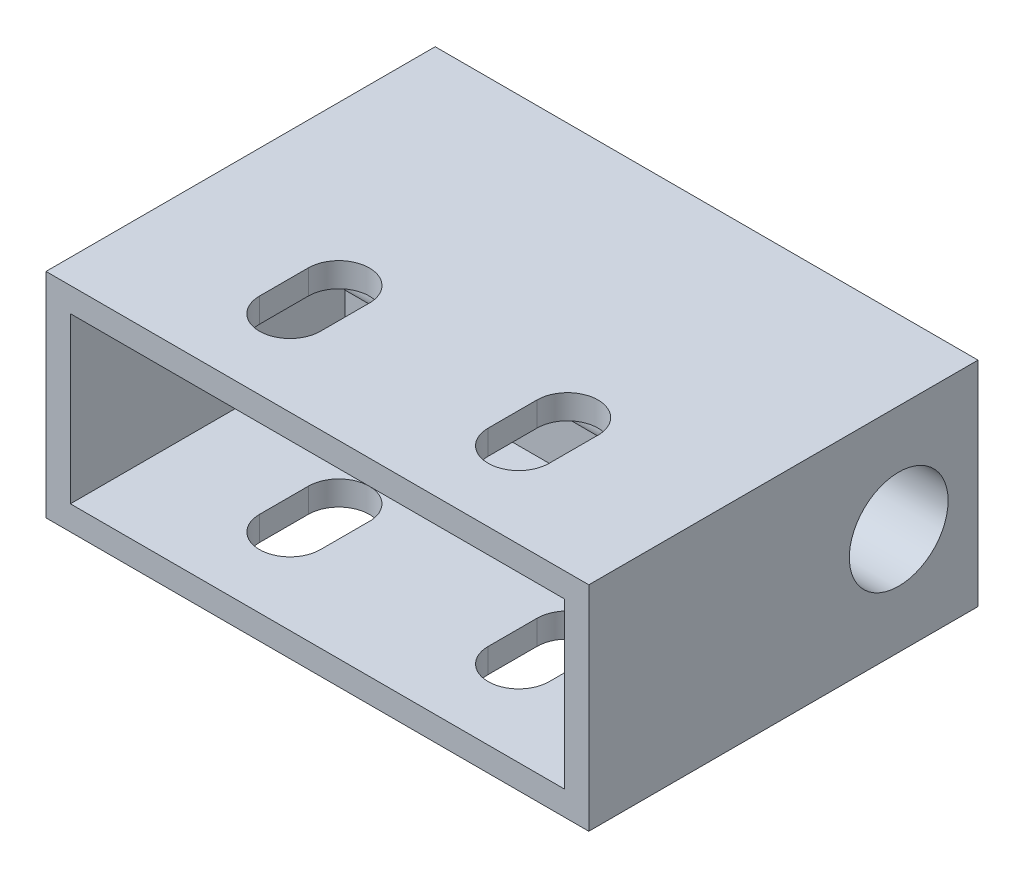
ISO-10303-21;
HEADER;
FILE_DESCRIPTION(('STEP AP214'),'2;1');
FILE_NAME('part.step','',(''),(''),'','','');
FILE_SCHEMA(('AUTOMOTIVE_DESIGN { 1 0 10303 214 1 1 1 1 }'));
ENDSEC;
DATA;
#1=APPLICATION_CONTEXT('core data for automotive mechanical design processes');
#2=APPLICATION_PROTOCOL_DEFINITION('international standard','automotive_design',2000,#1);
#3=PRODUCT_CONTEXT('',#1,'mechanical');
#4=PRODUCT('Part','Part','',(#3));
#5=PRODUCT_RELATED_PRODUCT_CATEGORY('part','',(#4));
#6=PRODUCT_DEFINITION_FORMATION('','',#4);
#7=PRODUCT_DEFINITION_CONTEXT('part definition',#1,'design');
#8=PRODUCT_DEFINITION('design','',#6,#7);
#9=PRODUCT_DEFINITION_SHAPE('','',#8);
#10=(LENGTH_UNIT() NAMED_UNIT(*) SI_UNIT(.MILLI.,.METRE.));
#11=(NAMED_UNIT(*) PLANE_ANGLE_UNIT() SI_UNIT($,.RADIAN.));
#12=(NAMED_UNIT(*) SI_UNIT($,.STERADIAN.) SOLID_ANGLE_UNIT());
#13=UNCERTAINTY_MEASURE_WITH_UNIT(LENGTH_MEASURE(1.E-05),#10,'distance_accuracy_value','');
#14=(GEOMETRIC_REPRESENTATION_CONTEXT(3) GLOBAL_UNCERTAINTY_ASSIGNED_CONTEXT((#13)) GLOBAL_UNIT_ASSIGNED_CONTEXT((#10,
#11,#12)) REPRESENTATION_CONTEXT('',''));
#15=CARTESIAN_POINT('',(0.,0.,0.));
#16=DIRECTION('',(0.,0.,1.));
#17=DIRECTION('',(1.,0.,0.));
#18=AXIS2_PLACEMENT_3D('',#15,#16,#17);
#19=CARTESIAN_POINT('',(0.,8.89,0.));
#20=DIRECTION('',(0.,-1.,0.));
#21=DIRECTION('',(0.,0.,-1.));
#22=AXIS2_PLACEMENT_3D('',#19,#20,#21);
#23=PLANE('',#22);
#24=DIRECTION('',(0.,0.,1.));
#25=VECTOR('',#24,1.);
#26=CARTESIAN_POINT('',(17.399,8.89,0.));
#27=LINE('',#26,#25);
#28=CARTESIAN_POINT('',(17.399,8.89,-5.4877915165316));
#29=VERTEX_POINT('',#28);
#30=CARTESIAN_POINT('',(17.399,8.89,-3.556));
#31=VERTEX_POINT('',#30);
#32=EDGE_CURVE('E59',#29,#31,#27,.T.);
#33=ORIENTED_EDGE('',*,*,#32,.T.);
#34=CARTESIAN_POINT('',(16.129,8.89,-3.556));
#35=DIRECTION('',(0.,1.,0.));
#36=DIRECTION('',(0.,0.,1.));
#37=AXIS2_PLACEMENT_3D('',#34,#35,#36);
#38=CIRCLE('',#37,1.27);
#39=CARTESIAN_POINT('',(14.859,8.89,-3.556));
#40=VERTEX_POINT('',#39);
#41=EDGE_CURVE('E251',#40,#31,#38,.T.);
#42=ORIENTED_EDGE('',*,*,#41,.F.);
#43=DIRECTION('',(0.,0.,1.));
#44=VECTOR('',#43,1.);
#45=CARTESIAN_POINT('',(14.859,8.89,0.));
#46=LINE('',#45,#44);
#47=CARTESIAN_POINT('',(14.859,8.89,-5.58799903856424));
#48=VERTEX_POINT('',#47);
#49=EDGE_CURVE('E248',#48,#40,#46,.T.);
#50=ORIENTED_EDGE('',*,*,#49,.F.);
#51=CARTESIAN_POINT('',(16.1309766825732,8.89,-5.58799903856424));
#52=DIRECTION('',(0.,1.,0.));
#53=DIRECTION('',(0.,0.,1.));
#54=AXIS2_PLACEMENT_3D('',#51,#52,#53);
#55=CIRCLE('',#54,1.27197668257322);
#56=EDGE_CURVE('E245',#29,#48,#55,.T.);
#57=ORIENTED_EDGE('',*,*,#56,.F.);
#58=EDGE_LOOP('',(#33,#42,#50,#57));
#59=FACE_BOUND('',#58,.T.);
#60=DIRECTION('',(0.,0.,1.));
#61=VECTOR('',#60,1.);
#62=CARTESIAN_POINT('',(0.,8.89,0.));
#63=LINE('',#62,#61);
#64=CARTESIAN_POINT('',(0.,8.89,-16.208375));
#65=VERTEX_POINT('',#64);
#66=CARTESIAN_POINT('',(0.,8.89,0.));
#67=VERTEX_POINT('',#66);
#68=EDGE_CURVE('E352',#65,#67,#63,.T.);
#69=ORIENTED_EDGE('',*,*,#68,.T.);
#70=DIRECTION('',(1.,0.,0.));
#71=VECTOR('',#70,1.);
#72=CARTESIAN_POINT('',(0.,8.89,0.));
#73=LINE('',#72,#71);
#74=CARTESIAN_POINT('',(22.606,8.89,0.));
#75=VERTEX_POINT('',#74);
#76=EDGE_CURVE('E355',#67,#75,#73,.T.);
#77=ORIENTED_EDGE('',*,*,#76,.T.);
#78=DIRECTION('',(0.,0.,-1.));
#79=VECTOR('',#78,1.);
#80=CARTESIAN_POINT('',(22.606,8.89,0.));
#81=LINE('',#80,#79);
#82=CARTESIAN_POINT('',(22.606,8.89,-16.208375));
#83=VERTEX_POINT('',#82);
#84=EDGE_CURVE('E358',#75,#83,#81,.T.);
#85=ORIENTED_EDGE('',*,*,#84,.T.);
#86=DIRECTION('',(-1.,0.,0.));
#87=VECTOR('',#86,1.);
#88=CARTESIAN_POINT('',(0.,8.89,-16.208375));
#89=LINE('',#88,#87);
#90=EDGE_CURVE('E360',#83,#65,#89,.T.);
#91=ORIENTED_EDGE('',*,*,#90,.T.);
#92=EDGE_LOOP('',(#69,#77,#85,#91));
#93=FACE_BOUND('',#92,.T.);
#94=DIRECTION('',(0.,0.,1.));
#95=VECTOR('',#94,1.);
#96=CARTESIAN_POINT('',(7.874,8.89,0.));
#97=LINE('',#96,#95);
#98=CARTESIAN_POINT('',(7.874,8.89,-5.48779151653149));
#99=VERTEX_POINT('',#98);
#100=CARTESIAN_POINT('',(7.874,8.89,-3.556));
#101=VERTEX_POINT('',#100);
#102=EDGE_CURVE('E51',#99,#101,#97,.T.);
#103=ORIENTED_EDGE('',*,*,#102,.T.);
#104=CARTESIAN_POINT('',(6.604,8.89,-3.556));
#105=DIRECTION('',(0.,1.,0.));
#106=DIRECTION('',(0.,0.,1.));
#107=AXIS2_PLACEMENT_3D('',#104,#105,#106);
#108=CIRCLE('',#107,1.27);
#109=CARTESIAN_POINT('',(5.334,8.89,-3.556));
#110=VERTEX_POINT('',#109);
#111=EDGE_CURVE('E232',#110,#101,#108,.T.);
#112=ORIENTED_EDGE('',*,*,#111,.F.);
#113=DIRECTION('',(0.,0.,1.));
#114=VECTOR('',#113,1.);
#115=CARTESIAN_POINT('',(5.334,8.89,0.));
#116=LINE('',#115,#114);
#117=CARTESIAN_POINT('',(5.334,8.89,-5.58799903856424));
#118=VERTEX_POINT('',#117);
#119=EDGE_CURVE('E216',#118,#110,#116,.T.);
#120=ORIENTED_EDGE('',*,*,#119,.F.);
#121=CARTESIAN_POINT('',(6.60597668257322,8.89,-5.58799903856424));
#122=DIRECTION('',(0.,1.,0.));
#123=DIRECTION('',(0.,0.,1.));
#124=AXIS2_PLACEMENT_3D('',#121,#122,#123);
#125=CIRCLE('',#124,1.27197668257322);
#126=EDGE_CURVE('E226',#99,#118,#125,.T.);
#127=ORIENTED_EDGE('',*,*,#126,.F.);
#128=EDGE_LOOP('',(#103,#112,#120,#127));
#129=FACE_BOUND('',#128,.T.);
#130=ADVANCED_FACE('F36',(#59,#93,#129),#23,.F.);
#131=CARTESIAN_POINT('',(0.,0.,0.));
#132=DIRECTION('',(0.,-1.,0.));
#133=DIRECTION('',(0.,0.,-1.));
#134=AXIS2_PLACEMENT_3D('',#131,#132,#133);
#135=PLANE('',#134);
#136=DIRECTION('',(0.,0.,1.));
#137=VECTOR('',#136,1.);
#138=CARTESIAN_POINT('',(0.,0.,0.));
#139=LINE('',#138,#137);
#140=CARTESIAN_POINT('',(0.,0.,-16.208375));
#141=VERTEX_POINT('',#140);
#142=CARTESIAN_POINT('',(0.,0.,0.));
#143=VERTEX_POINT('',#142);
#144=EDGE_CURVE('E345',#141,#143,#139,.T.);
#145=ORIENTED_EDGE('',*,*,#144,.F.);
#146=DIRECTION('',(-1.,0.,0.));
#147=VECTOR('',#146,1.);
#148=CARTESIAN_POINT('',(0.,0.,-16.208375));
#149=LINE('',#148,#147);
#150=CARTESIAN_POINT('',(22.606,0.,-16.208375));
#151=VERTEX_POINT('',#150);
#152=EDGE_CURVE('E356',#151,#141,#149,.T.);
#153=ORIENTED_EDGE('',*,*,#152,.F.);
#154=DIRECTION('',(0.,0.,-1.));
#155=VECTOR('',#154,1.);
#156=CARTESIAN_POINT('',(22.606,0.,0.));
#157=LINE('',#156,#155);
#158=CARTESIAN_POINT('',(22.606,0.,0.));
#159=VERTEX_POINT('',#158);
#160=EDGE_CURVE('E367',#159,#151,#157,.T.);
#161=ORIENTED_EDGE('',*,*,#160,.F.);
#162=DIRECTION('',(1.,0.,0.));
#163=VECTOR('',#162,1.);
#164=CARTESIAN_POINT('',(0.,0.,0.));
#165=LINE('',#164,#163);
#166=EDGE_CURVE('E365',#143,#159,#165,.T.);
#167=ORIENTED_EDGE('',*,*,#166,.F.);
#168=EDGE_LOOP('',(#145,#153,#161,#167));
#169=FACE_BOUND('',#168,.T.);
#170=CARTESIAN_POINT('',(16.129,0.,-3.556));
#171=DIRECTION('',(0.,-1.,0.));
#172=DIRECTION('',(0.,0.,-1.));
#173=AXIS2_PLACEMENT_3D('',#170,#171,#172);
#174=CIRCLE('',#173,1.27);
#175=CARTESIAN_POINT('',(17.399,0.,-3.556));
#176=VERTEX_POINT('',#175);
#177=CARTESIAN_POINT('',(14.859,0.,-3.556));
#178=VERTEX_POINT('',#177);
#179=EDGE_CURVE('E280',#176,#178,#174,.T.);
#180=ORIENTED_EDGE('',*,*,#179,.F.);
#181=DIRECTION('',(0.,0.,-1.));
#182=VECTOR('',#181,1.);
#183=CARTESIAN_POINT('',(17.399,0.,0.));
#184=LINE('',#183,#182);
#185=CARTESIAN_POINT('',(17.399,0.,-5.4877915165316));
#186=VERTEX_POINT('',#185);
#187=EDGE_CURVE('E284',#176,#186,#184,.T.);
#188=ORIENTED_EDGE('',*,*,#187,.T.);
#189=CARTESIAN_POINT('',(16.1309766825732,0.,-5.58799903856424));
#190=DIRECTION('',(0.,-1.,0.));
#191=DIRECTION('',(0.,0.,-1.));
#192=AXIS2_PLACEMENT_3D('',#189,#190,#191);
#193=CIRCLE('',#192,1.27197668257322);
#194=CARTESIAN_POINT('',(14.859,0.,-5.58799903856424));
#195=VERTEX_POINT('',#194);
#196=EDGE_CURVE('E269',#195,#186,#193,.T.);
#197=ORIENTED_EDGE('',*,*,#196,.F.);
#198=DIRECTION('',(0.,0.,-1.));
#199=VECTOR('',#198,1.);
#200=CARTESIAN_POINT('',(14.859,0.,0.));
#201=LINE('',#200,#199);
#202=EDGE_CURVE('E274',#178,#195,#201,.T.);
#203=ORIENTED_EDGE('',*,*,#202,.F.);
#204=EDGE_LOOP('',(#180,#188,#197,#203));
#205=FACE_BOUND('',#204,.T.);
#206=CARTESIAN_POINT('',(6.604,0.,-3.556));
#207=DIRECTION('',(0.,-1.,0.));
#208=DIRECTION('',(0.,0.,-1.));
#209=AXIS2_PLACEMENT_3D('',#206,#207,#208);
#210=CIRCLE('',#209,1.27);
#211=CARTESIAN_POINT('',(7.874,0.,-3.556));
#212=VERTEX_POINT('',#211);
#213=CARTESIAN_POINT('',(5.334,0.,-3.556));
#214=VERTEX_POINT('',#213);
#215=EDGE_CURVE('E298',#212,#214,#210,.T.);
#216=ORIENTED_EDGE('',*,*,#215,.F.);
#217=DIRECTION('',(0.,0.,-1.));
#218=VECTOR('',#217,1.);
#219=CARTESIAN_POINT('',(7.874,0.,0.));
#220=LINE('',#219,#218);
#221=CARTESIAN_POINT('',(7.874,0.,-5.48779151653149));
#222=VERTEX_POINT('',#221);
#223=EDGE_CURVE('E302',#212,#222,#220,.T.);
#224=ORIENTED_EDGE('',*,*,#223,.T.);
#225=CARTESIAN_POINT('',(6.60597668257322,0.,-5.58799903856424));
#226=DIRECTION('',(0.,-1.,0.));
#227=DIRECTION('',(0.,0.,-1.));
#228=AXIS2_PLACEMENT_3D('',#225,#226,#227);
#229=CIRCLE('',#228,1.27197668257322);
#230=CARTESIAN_POINT('',(5.334,0.,-5.58799903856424));
#231=VERTEX_POINT('',#230);
#232=EDGE_CURVE('E289',#231,#222,#229,.T.);
#233=ORIENTED_EDGE('',*,*,#232,.F.);
#234=DIRECTION('',(0.,0.,-1.));
#235=VECTOR('',#234,1.);
#236=CARTESIAN_POINT('',(5.334,0.,0.));
#237=LINE('',#236,#235);
#238=EDGE_CURVE('E292',#214,#231,#237,.T.);
#239=ORIENTED_EDGE('',*,*,#238,.F.);
#240=EDGE_LOOP('',(#216,#224,#233,#239));
#241=FACE_BOUND('',#240,.T.);
#242=ADVANCED_FACE('F418',(#169,#205,#241),#135,.T.);
#243=CARTESIAN_POINT('',(1.016,7.874,-11.43));
#244=DIRECTION('',(0.,1.,0.));
#245=DIRECTION('',(0.,0.,1.));
#246=AXIS2_PLACEMENT_3D('',#243,#244,#245);
#247=PLANE('',#246);
#248=DIRECTION('',(0.,0.,1.));
#249=VECTOR('',#248,1.);
#250=CARTESIAN_POINT('',(17.399,7.874,-11.43));
#251=LINE('',#250,#249);
#252=CARTESIAN_POINT('',(17.399,7.874,-5.4877915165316));
#253=VERTEX_POINT('',#252);
#254=CARTESIAN_POINT('',(17.399,7.874,-3.556));
#255=VERTEX_POINT('',#254);
#256=EDGE_CURVE('E282',#253,#255,#251,.T.);
#257=ORIENTED_EDGE('',*,*,#256,.F.);
#258=CARTESIAN_POINT('',(16.1309766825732,7.874,-5.58799903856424));
#259=DIRECTION('',(0.,1.,0.));
#260=DIRECTION('',(0.,0.,1.));
#261=AXIS2_PLACEMENT_3D('',#258,#259,#260);
#262=CIRCLE('',#261,1.27197668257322);
#263=CARTESIAN_POINT('',(14.859,7.874,-5.58799903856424));
#264=VERTEX_POINT('',#263);
#265=EDGE_CURVE('E266',#253,#264,#262,.T.);
#266=ORIENTED_EDGE('',*,*,#265,.T.);
#267=DIRECTION('',(0.,0.,1.));
#268=VECTOR('',#267,1.);
#269=CARTESIAN_POINT('',(14.859,7.874,-11.43));
#270=LINE('',#269,#268);
#271=CARTESIAN_POINT('',(14.859,7.874,-3.556));
#272=VERTEX_POINT('',#271);
#273=EDGE_CURVE('E271',#264,#272,#270,.T.);
#274=ORIENTED_EDGE('',*,*,#273,.T.);
#275=CARTESIAN_POINT('',(16.129,7.874,-3.556));
#276=DIRECTION('',(0.,1.,0.));
#277=DIRECTION('',(0.,0.,1.));
#278=AXIS2_PLACEMENT_3D('',#275,#276,#277);
#279=CIRCLE('',#278,1.27);
#280=EDGE_CURVE('E277',#272,#255,#279,.T.);
#281=ORIENTED_EDGE('',*,*,#280,.T.);
#282=EDGE_LOOP('',(#257,#266,#274,#281));
#283=FACE_BOUND('',#282,.T.);
#284=DIRECTION('',(-1.,0.,0.));
#285=VECTOR('',#284,1.);
#286=CARTESIAN_POINT('',(1.016,7.874,0.));
#287=LINE('',#286,#285);
#288=CARTESIAN_POINT('',(21.59,7.874,0.));
#289=VERTEX_POINT('',#288);
#290=CARTESIAN_POINT('',(1.016,7.874,0.));
#291=VERTEX_POINT('',#290);
#292=EDGE_CURVE('E340',#289,#291,#287,.T.);
#293=ORIENTED_EDGE('',*,*,#292,.T.);
#294=DIRECTION('',(0.,0.,1.));
#295=VECTOR('',#294,1.);
#296=CARTESIAN_POINT('',(1.016,7.874,-11.43));
#297=LINE('',#296,#295);
#298=CARTESIAN_POINT('',(1.016,7.874,-11.43));
#299=VERTEX_POINT('',#298);
#300=EDGE_CURVE('E343',#299,#291,#297,.T.);
#301=ORIENTED_EDGE('',*,*,#300,.F.);
#302=DIRECTION('',(-1.,0.,0.));
#303=VECTOR('',#302,1.);
#304=CARTESIAN_POINT('',(1.016,7.874,-11.43));
#305=LINE('',#304,#303);
#306=CARTESIAN_POINT('',(21.59,7.874,-11.43));
#307=VERTEX_POINT('',#306);
#308=EDGE_CURVE('E329',#307,#299,#305,.T.);
#309=ORIENTED_EDGE('',*,*,#308,.F.);
#310=DIRECTION('',(0.,0.,1.));
#311=VECTOR('',#310,1.);
#312=CARTESIAN_POINT('',(21.59,7.874,-11.43));
#313=LINE('',#312,#311);
#314=EDGE_CURVE('E346',#307,#289,#313,.T.);
#315=ORIENTED_EDGE('',*,*,#314,.T.);
#316=EDGE_LOOP('',(#293,#301,#309,#315));
#317=FACE_BOUND('',#316,.T.);
#318=DIRECTION('',(0.,0.,1.));
#319=VECTOR('',#318,1.);
#320=CARTESIAN_POINT('',(7.874,7.874,-11.43));
#321=LINE('',#320,#319);
#322=CARTESIAN_POINT('',(7.874,7.874,-5.48779151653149));
#323=VERTEX_POINT('',#322);
#324=CARTESIAN_POINT('',(7.874,7.874,-3.556));
#325=VERTEX_POINT('',#324);
#326=EDGE_CURVE('E300',#323,#325,#321,.T.);
#327=ORIENTED_EDGE('',*,*,#326,.F.);
#328=CARTESIAN_POINT('',(6.60597668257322,7.874,-5.58799903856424));
#329=DIRECTION('',(0.,1.,0.));
#330=DIRECTION('',(0.,0.,1.));
#331=AXIS2_PLACEMENT_3D('',#328,#329,#330);
#332=CIRCLE('',#331,1.27197668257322);
#333=CARTESIAN_POINT('',(5.334,7.874,-5.58799903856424));
#334=VERTEX_POINT('',#333);
#335=EDGE_CURVE('E287',#323,#334,#332,.T.);
#336=ORIENTED_EDGE('',*,*,#335,.T.);
#337=DIRECTION('',(0.,0.,1.));
#338=VECTOR('',#337,1.);
#339=CARTESIAN_POINT('',(5.334,7.874,-11.43));
#340=LINE('',#339,#338);
#341=CARTESIAN_POINT('',(5.334,7.874,-3.556));
#342=VERTEX_POINT('',#341);
#343=EDGE_CURVE('E219',#334,#342,#340,.T.);
#344=ORIENTED_EDGE('',*,*,#343,.T.);
#345=CARTESIAN_POINT('',(6.604,7.874,-3.556));
#346=DIRECTION('',(0.,1.,0.));
#347=DIRECTION('',(0.,0.,1.));
#348=AXIS2_PLACEMENT_3D('',#345,#346,#347);
#349=CIRCLE('',#348,1.27);
#350=EDGE_CURVE('E295',#342,#325,#349,.T.);
#351=ORIENTED_EDGE('',*,*,#350,.T.);
#352=EDGE_LOOP('',(#327,#336,#344,#351));
#353=FACE_BOUND('',#352,.T.);
#354=ADVANCED_FACE('F445',(#283,#317,#353),#247,.F.);
#355=CARTESIAN_POINT('',(1.016,1.016,-11.43));
#356=DIRECTION('',(0.,-1.,0.));
#357=DIRECTION('',(0.,0.,-1.));
#358=AXIS2_PLACEMENT_3D('',#355,#356,#357);
#359=PLANE('',#358);
#360=DIRECTION('',(0.,0.,-1.));
#361=VECTOR('',#360,1.);
#362=CARTESIAN_POINT('',(17.399,1.016,-11.43));
#363=LINE('',#362,#361);
#364=CARTESIAN_POINT('',(17.399,1.016,-3.556));
#365=VERTEX_POINT('',#364);
#366=CARTESIAN_POINT('',(17.399,1.016,-5.4877915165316));
#367=VERTEX_POINT('',#366);
#368=EDGE_CURVE('E394',#365,#367,#363,.T.);
#369=ORIENTED_EDGE('',*,*,#368,.F.);
#370=CARTESIAN_POINT('',(16.129,1.016,-3.556));
#371=DIRECTION('',(0.,-1.,0.));
#372=DIRECTION('',(0.,0.,-1.));
#373=AXIS2_PLACEMENT_3D('',#370,#371,#372);
#374=CIRCLE('',#373,1.27);
#375=CARTESIAN_POINT('',(14.859,1.016,-3.556));
#376=VERTEX_POINT('',#375);
#377=EDGE_CURVE('E391',#365,#376,#374,.T.);
#378=ORIENTED_EDGE('',*,*,#377,.T.);
#379=DIRECTION('',(0.,0.,-1.));
#380=VECTOR('',#379,1.);
#381=CARTESIAN_POINT('',(14.859,1.016,-11.43));
#382=LINE('',#381,#380);
#383=CARTESIAN_POINT('',(14.859,1.016,-5.58799903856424));
#384=VERTEX_POINT('',#383);
#385=EDGE_CURVE('E388',#376,#384,#382,.T.);
#386=ORIENTED_EDGE('',*,*,#385,.T.);
#387=CARTESIAN_POINT('',(16.1309766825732,1.016,-5.58799903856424));
#388=DIRECTION('',(0.,-1.,0.));
#389=DIRECTION('',(0.,0.,-1.));
#390=AXIS2_PLACEMENT_3D('',#387,#388,#389);
#391=CIRCLE('',#390,1.27197668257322);
#392=EDGE_CURVE('E385',#384,#367,#391,.T.);
#393=ORIENTED_EDGE('',*,*,#392,.T.);
#394=EDGE_LOOP('',(#369,#378,#386,#393));
#395=FACE_BOUND('',#394,.T.);
#396=DIRECTION('',(1.,0.,0.));
#397=VECTOR('',#396,1.);
#398=CARTESIAN_POINT('',(1.016,1.016,0.));
#399=LINE('',#398,#397);
#400=CARTESIAN_POINT('',(1.016,1.016,0.));
#401=VERTEX_POINT('',#400);
#402=CARTESIAN_POINT('',(21.59,1.016,0.));
#403=VERTEX_POINT('',#402);
#404=EDGE_CURVE('E334',#401,#403,#399,.T.);
#405=ORIENTED_EDGE('',*,*,#404,.T.);
#406=DIRECTION('',(0.,0.,1.));
#407=VECTOR('',#406,1.);
#408=CARTESIAN_POINT('',(21.59,1.016,-11.43));
#409=LINE('',#408,#407);
#410=CARTESIAN_POINT('',(21.59,1.016,-11.43));
#411=VERTEX_POINT('',#410);
#412=EDGE_CURVE('E348',#411,#403,#409,.T.);
#413=ORIENTED_EDGE('',*,*,#412,.F.);
#414=DIRECTION('',(1.,0.,0.));
#415=VECTOR('',#414,1.);
#416=CARTESIAN_POINT('',(1.016,1.016,-11.43));
#417=LINE('',#416,#415);
#418=CARTESIAN_POINT('',(1.016,1.016,-11.43));
#419=VERTEX_POINT('',#418);
#420=EDGE_CURVE('E321',#419,#411,#417,.T.);
#421=ORIENTED_EDGE('',*,*,#420,.F.);
#422=DIRECTION('',(0.,0.,1.));
#423=VECTOR('',#422,1.);
#424=CARTESIAN_POINT('',(1.016,1.016,-11.43));
#425=LINE('',#424,#423);
#426=EDGE_CURVE('E332',#419,#401,#425,.T.);
#427=ORIENTED_EDGE('',*,*,#426,.T.);
#428=EDGE_LOOP('',(#405,#413,#421,#427));
#429=FACE_BOUND('',#428,.T.);
#430=DIRECTION('',(0.,0.,-1.));
#431=VECTOR('',#430,1.);
#432=CARTESIAN_POINT('',(7.874,1.016,-11.43));
#433=LINE('',#432,#431);
#434=CARTESIAN_POINT('',(7.874,1.016,-3.556));
#435=VERTEX_POINT('',#434);
#436=CARTESIAN_POINT('',(7.874,1.016,-5.48779151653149));
#437=VERTEX_POINT('',#436);
#438=EDGE_CURVE('E11',#435,#437,#433,.T.);
#439=ORIENTED_EDGE('',*,*,#438,.F.);
#440=CARTESIAN_POINT('',(6.604,1.016,-3.556));
#441=DIRECTION('',(0.,-1.,0.));
#442=DIRECTION('',(0.,0.,-1.));
#443=AXIS2_PLACEMENT_3D('',#440,#441,#442);
#444=CIRCLE('',#443,1.27);
#445=CARTESIAN_POINT('',(5.334,1.016,-3.556));
#446=VERTEX_POINT('',#445);
#447=EDGE_CURVE('E44',#435,#446,#444,.T.);
#448=ORIENTED_EDGE('',*,*,#447,.T.);
#449=DIRECTION('',(0.,0.,-1.));
#450=VECTOR('',#449,1.);
#451=CARTESIAN_POINT('',(5.334,1.016,-11.43));
#452=LINE('',#451,#450);
#453=CARTESIAN_POINT('',(5.334,1.016,-5.58799903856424));
#454=VERTEX_POINT('',#453);
#455=EDGE_CURVE('E400',#446,#454,#452,.T.);
#456=ORIENTED_EDGE('',*,*,#455,.T.);
#457=CARTESIAN_POINT('',(6.60597668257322,1.016,-5.58799903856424));
#458=DIRECTION('',(0.,-1.,0.));
#459=DIRECTION('',(0.,0.,-1.));
#460=AXIS2_PLACEMENT_3D('',#457,#458,#459);
#461=CIRCLE('',#460,1.27197668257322);
#462=EDGE_CURVE('E397',#454,#437,#461,.T.);
#463=ORIENTED_EDGE('',*,*,#462,.T.);
#464=EDGE_LOOP('',(#439,#448,#456,#463));
#465=FACE_BOUND('',#464,.T.);
#466=ADVANCED_FACE('F405',(#395,#429,#465),#359,.F.);
#467=CARTESIAN_POINT('',(0.,0.,-11.43));
#468=DIRECTION('',(0.,0.,1.));
#469=DIRECTION('',(1.,0.,0.));
#470=AXIS2_PLACEMENT_3D('',#467,#468,#469);
#471=PLANE('',#470);
#472=DIRECTION('',(1.,0.,0.));
#473=VECTOR('',#472,1.);
#474=CARTESIAN_POINT('',(-31.4204800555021,3.01209678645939,-11.43));
#475=LINE('',#474,#473);
#476=CARTESIAN_POINT('',(1.016,3.01209678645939,-11.43));
#477=VERTEX_POINT('',#476);
#478=CARTESIAN_POINT('',(21.59,3.01209678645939,-11.43));
#479=VERTEX_POINT('',#478);
#480=EDGE_CURVE('E383',#477,#479,#475,.T.);
#481=ORIENTED_EDGE('',*,*,#480,.F.);
#482=DIRECTION('',(0.,-1.,0.));
#483=VECTOR('',#482,1.);
#484=CARTESIAN_POINT('',(1.016,7.874,-11.43));
#485=LINE('',#484,#483);
#486=EDGE_CURVE('E322',#477,#419,#485,.T.);
#487=ORIENTED_EDGE('',*,*,#486,.T.);
#488=ORIENTED_EDGE('',*,*,#420,.T.);
#489=DIRECTION('',(0.,1.,0.));
#490=VECTOR('',#489,1.);
#491=CARTESIAN_POINT('',(21.59,7.874,-11.43));
#492=LINE('',#491,#490);
#493=EDGE_CURVE('E326',#411,#479,#492,.T.);
#494=ORIENTED_EDGE('',*,*,#493,.T.);
#495=EDGE_LOOP('',(#481,#487,#488,#494));
#496=FACE_BOUND('',#495,.T.);
#497=ADVANCED_FACE('F466',(#496),#471,.T.);
#498=CARTESIAN_POINT('',(0.,8.89,0.));
#499=DIRECTION('',(1.,0.,0.));
#500=DIRECTION('',(0.,0.,-1.));
#501=AXIS2_PLACEMENT_3D('',#498,#499,#500);
#502=PLANE('',#501);
#503=CARTESIAN_POINT('',(0.,4.445,-12.906375));
#504=DIRECTION('',(1.,0.,0.));
#505=DIRECTION('',(0.,0.,-1.));
#506=AXIS2_PLACEMENT_3D('',#503,#504,#505);
#507=CIRCLE('',#506,2.0574);
#508=CARTESIAN_POINT('',(0.,4.445,-14.963775));
#509=VERTEX_POINT('',#508);
#510=EDGE_CURVE('E314',#509,#509,#507,.T.);
#511=ORIENTED_EDGE('',*,*,#510,.T.);
#512=EDGE_LOOP('',(#511));
#513=FACE_BOUND('',#512,.T.);
#514=ORIENTED_EDGE('',*,*,#144,.T.);
#515=DIRECTION('',(0.,-1.,0.));
#516=VECTOR('',#515,1.);
#517=CARTESIAN_POINT('',(0.,8.89,0.));
#518=LINE('',#517,#516);
#519=EDGE_CURVE('E378',#67,#143,#518,.T.);
#520=ORIENTED_EDGE('',*,*,#519,.F.);
#521=ORIENTED_EDGE('',*,*,#68,.F.);
#522=DIRECTION('',(0.,-1.,0.));
#523=VECTOR('',#522,1.);
#524=CARTESIAN_POINT('',(0.,8.89,-16.208375));
#525=LINE('',#524,#523);
#526=EDGE_CURVE('E362',#65,#141,#525,.T.);
#527=ORIENTED_EDGE('',*,*,#526,.T.);
#528=EDGE_LOOP('',(#514,#520,#521,#527));
#529=FACE_BOUND('',#528,.T.);
#530=ADVANCED_FACE('F38',(#513,#529),#502,.F.);
#531=CARTESIAN_POINT('',(0.,8.89,0.));
#532=DIRECTION('',(0.,0.,-1.));
#533=DIRECTION('',(-1.,0.,0.));
#534=AXIS2_PLACEMENT_3D('',#531,#532,#533);
#535=PLANE('',#534);
#536=ORIENTED_EDGE('',*,*,#404,.F.);
#537=DIRECTION('',(0.,-1.,0.));
#538=VECTOR('',#537,1.);
#539=CARTESIAN_POINT('',(1.016,7.874,0.));
#540=LINE('',#539,#538);
#541=EDGE_CURVE('E317',#291,#401,#540,.T.);
#542=ORIENTED_EDGE('',*,*,#541,.F.);
#543=ORIENTED_EDGE('',*,*,#292,.F.);
#544=DIRECTION('',(0.,1.,0.));
#545=VECTOR('',#544,1.);
#546=CARTESIAN_POINT('',(21.59,7.874,0.));
#547=LINE('',#546,#545);
#548=EDGE_CURVE('E337',#403,#289,#547,.T.);
#549=ORIENTED_EDGE('',*,*,#548,.F.);
#550=EDGE_LOOP('',(#536,#542,#543,#549));
#551=FACE_BOUND('',#550,.T.);
#552=ORIENTED_EDGE('',*,*,#166,.T.);
#553=DIRECTION('',(0.,-1.,0.));
#554=VECTOR('',#553,1.);
#555=CARTESIAN_POINT('',(22.606,8.89,0.));
#556=LINE('',#555,#554);
#557=EDGE_CURVE('E375',#75,#159,#556,.T.);
#558=ORIENTED_EDGE('',*,*,#557,.F.);
#559=ORIENTED_EDGE('',*,*,#76,.F.);
#560=ORIENTED_EDGE('',*,*,#519,.T.);
#561=EDGE_LOOP('',(#552,#558,#559,#560));
#562=FACE_BOUND('',#561,.T.);
#563=ADVANCED_FACE('F459',(#551,#562),#535,.F.);
#564=CARTESIAN_POINT('',(22.606,8.89,0.));
#565=DIRECTION('',(-1.,0.,0.));
#566=DIRECTION('',(0.,0.,1.));
#567=AXIS2_PLACEMENT_3D('',#564,#565,#566);
#568=PLANE('',#567);
#569=CARTESIAN_POINT('',(22.606,4.445,-12.906375));
#570=DIRECTION('',(1.,0.,0.));
#571=DIRECTION('',(0.,0.,-1.));
#572=AXIS2_PLACEMENT_3D('',#569,#570,#571);
#573=CIRCLE('',#572,2.0574);
#574=CARTESIAN_POINT('',(22.606,4.445,-14.963775));
#575=VERTEX_POINT('',#574);
#576=EDGE_CURVE('E305',#575,#575,#573,.T.);
#577=ORIENTED_EDGE('',*,*,#576,.F.);
#578=EDGE_LOOP('',(#577));
#579=FACE_BOUND('',#578,.T.);
#580=ORIENTED_EDGE('',*,*,#160,.T.);
#581=DIRECTION('',(0.,-1.,0.));
#582=VECTOR('',#581,1.);
#583=CARTESIAN_POINT('',(22.606,8.89,-16.208375));
#584=LINE('',#583,#582);
#585=EDGE_CURVE('E372',#83,#151,#584,.T.);
#586=ORIENTED_EDGE('',*,*,#585,.F.);
#587=ORIENTED_EDGE('',*,*,#84,.F.);
#588=ORIENTED_EDGE('',*,*,#557,.T.);
#589=EDGE_LOOP('',(#580,#586,#587,#588));
#590=FACE_BOUND('',#589,.T.);
#591=ADVANCED_FACE('F456',(#579,#590),#568,.F.);
#592=CARTESIAN_POINT('',(0.,8.89,-16.208375));
#593=DIRECTION('',(0.,0.,1.));
#594=DIRECTION('',(1.,0.,0.));
#595=AXIS2_PLACEMENT_3D('',#592,#593,#594);
#596=PLANE('',#595);
#597=ORIENTED_EDGE('',*,*,#152,.T.);
#598=ORIENTED_EDGE('',*,*,#526,.F.);
#599=ORIENTED_EDGE('',*,*,#90,.F.);
#600=ORIENTED_EDGE('',*,*,#585,.T.);
#601=EDGE_LOOP('',(#597,#598,#599,#600));
#602=FACE_BOUND('',#601,.T.);
#603=ADVANCED_FACE('F453',(#602),#596,.F.);
#604=CARTESIAN_POINT('',(1.016,7.874,-11.43));
#605=DIRECTION('',(-1.,0.,0.));
#606=DIRECTION('',(0.,-1.,0.));
#607=AXIS2_PLACEMENT_3D('',#604,#605,#606);
#608=PLANE('',#607);
#609=ORIENTED_EDGE('',*,*,#486,.F.);
#610=CARTESIAN_POINT('',(1.016,4.445,-12.906375));
#611=DIRECTION('',(-1.,0.,0.));
#612=DIRECTION('',(0.,-1.,0.));
#613=AXIS2_PLACEMENT_3D('',#610,#611,#612);
#614=CIRCLE('',#613,2.0574);
#615=CARTESIAN_POINT('',(1.016,5.87790321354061,-11.43));
#616=VERTEX_POINT('',#615);
#617=EDGE_CURVE('E311',#477,#616,#614,.T.);
#618=ORIENTED_EDGE('',*,*,#617,.T.);
#619=EDGE_CURVE('E318',#299,#616,#485,.T.);
#620=ORIENTED_EDGE('',*,*,#619,.F.);
#621=ORIENTED_EDGE('',*,*,#300,.T.);
#622=ORIENTED_EDGE('',*,*,#541,.T.);
#623=ORIENTED_EDGE('',*,*,#426,.F.);
#624=EDGE_LOOP('',(#609,#618,#620,#621,#622,#623));
#625=FACE_BOUND('',#624,.T.);
#626=ADVANCED_FACE('F450',(#625),#608,.F.);
#627=CARTESIAN_POINT('',(21.59,7.874,-11.43));
#628=DIRECTION('',(1.,0.,0.));
#629=DIRECTION('',(0.,0.,-1.));
#630=AXIS2_PLACEMENT_3D('',#627,#628,#629);
#631=PLANE('',#630);
#632=CARTESIAN_POINT('',(21.59,5.87790321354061,-11.43));
#633=VERTEX_POINT('',#632);
#634=EDGE_CURVE('E325',#633,#307,#492,.T.);
#635=ORIENTED_EDGE('',*,*,#634,.F.);
#636=CARTESIAN_POINT('',(21.59,4.445,-12.906375));
#637=DIRECTION('',(1.,0.,0.));
#638=DIRECTION('',(0.,0.,-1.));
#639=AXIS2_PLACEMENT_3D('',#636,#637,#638);
#640=CIRCLE('',#639,2.0574);
#641=EDGE_CURVE('E308',#633,#479,#640,.T.);
#642=ORIENTED_EDGE('',*,*,#641,.T.);
#643=ORIENTED_EDGE('',*,*,#493,.F.);
#644=ORIENTED_EDGE('',*,*,#412,.T.);
#645=ORIENTED_EDGE('',*,*,#548,.T.);
#646=ORIENTED_EDGE('',*,*,#314,.F.);
#647=EDGE_LOOP('',(#635,#642,#643,#644,#645,#646));
#648=FACE_BOUND('',#647,.T.);
#649=ADVANCED_FACE('F635',(#648),#631,.F.);
#650=DIRECTION('',(1.,0.,0.));
#651=VECTOR('',#650,1.);
#652=CARTESIAN_POINT('',(-31.4204800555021,5.87790321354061,-11.43));
#653=LINE('',#652,#651);
#654=EDGE_CURVE('E381',#633,#616,#653,.F.);
#655=ORIENTED_EDGE('',*,*,#654,.F.);
#656=ORIENTED_EDGE('',*,*,#634,.T.);
#657=ORIENTED_EDGE('',*,*,#308,.T.);
#658=ORIENTED_EDGE('',*,*,#619,.T.);
#659=EDGE_LOOP('',(#655,#656,#657,#658));
#660=FACE_BOUND('',#659,.T.);
#661=ADVANCED_FACE('F512',(#660),#471,.T.);
#662=CARTESIAN_POINT('',(-31.4204800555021,4.445,-12.906375));
#663=DIRECTION('',(1.,0.,0.));
#664=DIRECTION('',(0.,0.,-1.));
#665=AXIS2_PLACEMENT_3D('',#662,#663,#664);
#666=CYLINDRICAL_SURFACE('',#665,2.0574);
#667=ORIENTED_EDGE('',*,*,#576,.T.);
#668=EDGE_LOOP('',(#667));
#669=FACE_BOUND('',#668,.T.);
#670=ORIENTED_EDGE('',*,*,#480,.T.);
#671=ORIENTED_EDGE('',*,*,#641,.F.);
#672=ORIENTED_EDGE('',*,*,#654,.T.);
#673=ORIENTED_EDGE('',*,*,#617,.F.);
#674=EDGE_LOOP('',(#670,#671,#672,#673));
#675=FACE_BOUND('',#674,.T.);
#676=ORIENTED_EDGE('',*,*,#510,.F.);
#677=EDGE_LOOP('',(#676));
#678=FACE_BOUND('',#677,.T.);
#679=ADVANCED_FACE('F503',(#669,#675,#678),#666,.F.);
#680=CARTESIAN_POINT('',(16.1309766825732,-13.8944800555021,-5.58799903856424));
#681=DIRECTION('',(0.,1.,0.));
#682=DIRECTION('',(0.,0.,1.));
#683=AXIS2_PLACEMENT_3D('',#680,#681,#682);
#684=CYLINDRICAL_SURFACE('',#683,1.27197668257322);
#685=ORIENTED_EDGE('',*,*,#196,.T.);
#686=DIRECTION('',(0.,1.,0.));
#687=VECTOR('',#686,1.);
#688=CARTESIAN_POINT('',(17.399,-13.8944800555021,-5.4877915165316));
#689=LINE('',#688,#687);
#690=EDGE_CURVE('E264',#186,#367,#689,.T.);
#691=ORIENTED_EDGE('',*,*,#690,.T.);
#692=ORIENTED_EDGE('',*,*,#392,.F.);
#693=DIRECTION('',(0.,1.,0.));
#694=VECTOR('',#693,1.);
#695=CARTESIAN_POINT('',(14.859,-13.8944800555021,-5.58799903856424));
#696=LINE('',#695,#694);
#697=EDGE_CURVE('E261',#195,#384,#696,.T.);
#698=ORIENTED_EDGE('',*,*,#697,.F.);
#699=EDGE_LOOP('',(#685,#691,#692,#698));
#700=FACE_BOUND('',#699,.T.);
#701=ADVANCED_FACE('F501',(#700),#684,.F.);
#702=CARTESIAN_POINT('',(14.859,-13.8944800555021,0.));
#703=DIRECTION('',(-1.,0.,0.));
#704=DIRECTION('',(0.,0.,1.));
#705=AXIS2_PLACEMENT_3D('',#702,#703,#704);
#706=PLANE('',#705);
#707=ORIENTED_EDGE('',*,*,#202,.T.);
#708=ORIENTED_EDGE('',*,*,#697,.T.);
#709=ORIENTED_EDGE('',*,*,#385,.F.);
#710=DIRECTION('',(0.,1.,0.));
#711=VECTOR('',#710,1.);
#712=CARTESIAN_POINT('',(14.859,-13.8944800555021,-3.556));
#713=LINE('',#712,#711);
#714=EDGE_CURVE('E258',#178,#376,#713,.T.);
#715=ORIENTED_EDGE('',*,*,#714,.F.);
#716=EDGE_LOOP('',(#707,#708,#709,#715));
#717=FACE_BOUND('',#716,.T.);
#718=ADVANCED_FACE('F494',(#717),#706,.F.);
#719=CARTESIAN_POINT('',(16.129,-13.8944800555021,-3.556));
#720=DIRECTION('',(0.,1.,0.));
#721=DIRECTION('',(0.,0.,1.));
#722=AXIS2_PLACEMENT_3D('',#719,#720,#721);
#723=CYLINDRICAL_SURFACE('',#722,1.27);
#724=ORIENTED_EDGE('',*,*,#179,.T.);
#725=ORIENTED_EDGE('',*,*,#714,.T.);
#726=ORIENTED_EDGE('',*,*,#377,.F.);
#727=DIRECTION('',(0.,1.,0.));
#728=VECTOR('',#727,1.);
#729=CARTESIAN_POINT('',(17.399,-13.8944800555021,-3.556));
#730=LINE('',#729,#728);
#731=EDGE_CURVE('E257',#176,#365,#730,.T.);
#732=ORIENTED_EDGE('',*,*,#731,.F.);
#733=EDGE_LOOP('',(#724,#725,#726,#732));
#734=FACE_BOUND('',#733,.T.);
#735=ADVANCED_FACE('F433',(#734),#723,.F.);
#736=CARTESIAN_POINT('',(17.399,-13.8944800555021,0.));
#737=DIRECTION('',(-1.,0.,0.));
#738=DIRECTION('',(0.,0.,1.));
#739=AXIS2_PLACEMENT_3D('',#736,#737,#738);
#740=PLANE('',#739);
#741=ORIENTED_EDGE('',*,*,#731,.T.);
#742=ORIENTED_EDGE('',*,*,#368,.T.);
#743=ORIENTED_EDGE('',*,*,#690,.F.);
#744=ORIENTED_EDGE('',*,*,#187,.F.);
#745=EDGE_LOOP('',(#741,#742,#743,#744));
#746=FACE_BOUND('',#745,.T.);
#747=ADVANCED_FACE('F426',(#746),#740,.T.);
#748=CARTESIAN_POINT('',(6.60597668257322,-13.8944800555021,-5.58799903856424));
#749=DIRECTION('',(0.,1.,0.));
#750=DIRECTION('',(0.,0.,1.));
#751=AXIS2_PLACEMENT_3D('',#748,#749,#750);
#752=CYLINDRICAL_SURFACE('',#751,1.27197668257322);
#753=ORIENTED_EDGE('',*,*,#232,.T.);
#754=DIRECTION('',(0.,1.,0.));
#755=VECTOR('',#754,1.);
#756=CARTESIAN_POINT('',(7.874,-13.8944800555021,-5.48779151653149));
#757=LINE('',#756,#755);
#758=EDGE_CURVE('E223',#222,#437,#757,.T.);
#759=ORIENTED_EDGE('',*,*,#758,.T.);
#760=ORIENTED_EDGE('',*,*,#462,.F.);
#761=DIRECTION('',(0.,1.,0.));
#762=VECTOR('',#761,1.);
#763=CARTESIAN_POINT('',(5.334,-13.8944800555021,-5.58799903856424));
#764=LINE('',#763,#762);
#765=EDGE_CURVE('E222',#231,#454,#764,.T.);
#766=ORIENTED_EDGE('',*,*,#765,.F.);
#767=EDGE_LOOP('',(#753,#759,#760,#766));
#768=FACE_BOUND('',#767,.T.);
#769=ADVANCED_FACE('F424',(#768),#752,.F.);
#770=CARTESIAN_POINT('',(5.334,-13.8944800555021,0.));
#771=DIRECTION('',(-1.,0.,0.));
#772=DIRECTION('',(0.,0.,1.));
#773=AXIS2_PLACEMENT_3D('',#770,#771,#772);
#774=PLANE('',#773);
#775=ORIENTED_EDGE('',*,*,#238,.T.);
#776=ORIENTED_EDGE('',*,*,#765,.T.);
#777=ORIENTED_EDGE('',*,*,#455,.F.);
#778=DIRECTION('',(0.,1.,0.));
#779=VECTOR('',#778,1.);
#780=CARTESIAN_POINT('',(5.334,-13.8944800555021,-3.556));
#781=LINE('',#780,#779);
#782=EDGE_CURVE('E240',#214,#446,#781,.T.);
#783=ORIENTED_EDGE('',*,*,#782,.F.);
#784=EDGE_LOOP('',(#775,#776,#777,#783));
#785=FACE_BOUND('',#784,.T.);
#786=ADVANCED_FACE('F421',(#785),#774,.F.);
#787=CARTESIAN_POINT('',(6.604,-13.8944800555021,-3.556));
#788=DIRECTION('',(0.,1.,0.));
#789=DIRECTION('',(0.,0.,1.));
#790=AXIS2_PLACEMENT_3D('',#787,#788,#789);
#791=CYLINDRICAL_SURFACE('',#790,1.27);
#792=ORIENTED_EDGE('',*,*,#215,.T.);
#793=ORIENTED_EDGE('',*,*,#782,.T.);
#794=ORIENTED_EDGE('',*,*,#447,.F.);
#795=DIRECTION('',(0.,1.,0.));
#796=VECTOR('',#795,1.);
#797=CARTESIAN_POINT('',(7.874,-13.8944800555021,-3.556));
#798=LINE('',#797,#796);
#799=EDGE_CURVE('E239',#212,#435,#798,.T.);
#800=ORIENTED_EDGE('',*,*,#799,.F.);
#801=EDGE_LOOP('',(#792,#793,#794,#800));
#802=FACE_BOUND('',#801,.T.);
#803=ADVANCED_FACE('F410',(#802),#791,.F.);
#804=CARTESIAN_POINT('',(7.874,-13.8944800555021,0.));
#805=DIRECTION('',(-1.,0.,0.));
#806=DIRECTION('',(0.,0.,1.));
#807=AXIS2_PLACEMENT_3D('',#804,#805,#806);
#808=PLANE('',#807);
#809=ORIENTED_EDGE('',*,*,#799,.T.);
#810=ORIENTED_EDGE('',*,*,#438,.T.);
#811=ORIENTED_EDGE('',*,*,#758,.F.);
#812=ORIENTED_EDGE('',*,*,#223,.F.);
#813=EDGE_LOOP('',(#809,#810,#811,#812));
#814=FACE_BOUND('',#813,.T.);
#815=ADVANCED_FACE('F414',(#814),#808,.T.);
#816=ORIENTED_EDGE('',*,*,#256,.T.);
#817=EDGE_CURVE('E255',#255,#31,#730,.T.);
#818=ORIENTED_EDGE('',*,*,#817,.T.);
#819=ORIENTED_EDGE('',*,*,#32,.F.);
#820=EDGE_CURVE('E254',#253,#29,#689,.T.);
#821=ORIENTED_EDGE('',*,*,#820,.F.);
#822=EDGE_LOOP('',(#816,#818,#819,#821));
#823=FACE_BOUND('',#822,.T.);
#824=ADVANCED_FACE('F436',(#823),#740,.T.);
#825=EDGE_CURVE('E259',#272,#40,#713,.T.);
#826=ORIENTED_EDGE('',*,*,#825,.T.);
#827=ORIENTED_EDGE('',*,*,#41,.T.);
#828=ORIENTED_EDGE('',*,*,#817,.F.);
#829=ORIENTED_EDGE('',*,*,#280,.F.);
#830=EDGE_LOOP('',(#826,#827,#828,#829));
#831=FACE_BOUND('',#830,.T.);
#832=ADVANCED_FACE('F523',(#831),#723,.F.);
#833=EDGE_CURVE('E262',#264,#48,#696,.T.);
#834=ORIENTED_EDGE('',*,*,#833,.T.);
#835=ORIENTED_EDGE('',*,*,#49,.T.);
#836=ORIENTED_EDGE('',*,*,#825,.F.);
#837=ORIENTED_EDGE('',*,*,#273,.F.);
#838=EDGE_LOOP('',(#834,#835,#836,#837));
#839=FACE_BOUND('',#838,.T.);
#840=ADVANCED_FACE('F511',(#839),#706,.F.);
#841=ORIENTED_EDGE('',*,*,#820,.T.);
#842=ORIENTED_EDGE('',*,*,#56,.T.);
#843=ORIENTED_EDGE('',*,*,#833,.F.);
#844=ORIENTED_EDGE('',*,*,#265,.F.);
#845=EDGE_LOOP('',(#841,#842,#843,#844));
#846=FACE_BOUND('',#845,.T.);
#847=ADVANCED_FACE('F505',(#846),#684,.F.);
#848=ORIENTED_EDGE('',*,*,#326,.T.);
#849=EDGE_CURVE('E237',#325,#101,#798,.T.);
#850=ORIENTED_EDGE('',*,*,#849,.T.);
#851=ORIENTED_EDGE('',*,*,#102,.F.);
#852=EDGE_CURVE('E228',#323,#99,#757,.T.);
#853=ORIENTED_EDGE('',*,*,#852,.F.);
#854=EDGE_LOOP('',(#848,#850,#851,#853));
#855=FACE_BOUND('',#854,.T.);
#856=ADVANCED_FACE('F516',(#855),#808,.T.);
#857=EDGE_CURVE('E241',#342,#110,#781,.T.);
#858=ORIENTED_EDGE('',*,*,#857,.T.);
#859=ORIENTED_EDGE('',*,*,#111,.T.);
#860=ORIENTED_EDGE('',*,*,#849,.F.);
#861=ORIENTED_EDGE('',*,*,#350,.F.);
#862=EDGE_LOOP('',(#858,#859,#860,#861));
#863=FACE_BOUND('',#862,.T.);
#864=ADVANCED_FACE('F522',(#863),#791,.F.);
#865=EDGE_CURVE('E211',#334,#118,#764,.T.);
#866=ORIENTED_EDGE('',*,*,#865,.T.);
#867=ORIENTED_EDGE('',*,*,#119,.T.);
#868=ORIENTED_EDGE('',*,*,#857,.F.);
#869=ORIENTED_EDGE('',*,*,#343,.F.);
#870=EDGE_LOOP('',(#866,#867,#868,#869));
#871=FACE_BOUND('',#870,.T.);
#872=ADVANCED_FACE('F213',(#871),#774,.F.);
#873=ORIENTED_EDGE('',*,*,#852,.T.);
#874=ORIENTED_EDGE('',*,*,#126,.T.);
#875=ORIENTED_EDGE('',*,*,#865,.F.);
#876=ORIENTED_EDGE('',*,*,#335,.F.);
#877=EDGE_LOOP('',(#873,#874,#875,#876));
#878=FACE_BOUND('',#877,.T.);
#879=ADVANCED_FACE('F227',(#878),#752,.F.);
#880=CLOSED_SHELL('',(#130,#242,#354,#466,#497,#530,#563,#591,#603,#626,#649,#661,#679,#701,
#718,#735,#747,#769,#786,#803,#815,#824,#832,#840,#847,#856,#864,#872,#879));
#881=MANIFOLD_SOLID_BREP('B2',#880);
#882=ADVANCED_BREP_SHAPE_REPRESENTATION('',(#18,#881),#14);
#883=SHAPE_DEFINITION_REPRESENTATION(#9,#882);
ENDSEC;
END-ISO-10303-21;
